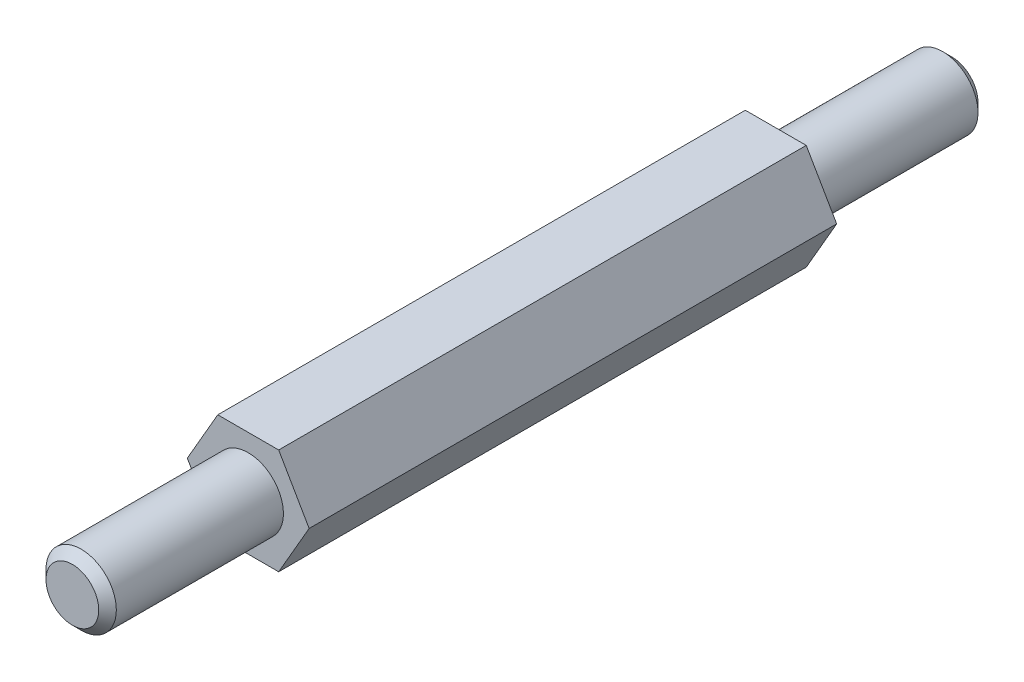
from build123d import *

# Parameters (mm, degrees)
BOSS_EXTRU_1_DEPTH = 30
ESQUISSE2_R        = 2
BOSS_EXTRU_2_DEPTH = 10
BOSS_EXTRU_3_START = 10
ESQUISSE3_R        = 2
BOSS_EXTRU_3_DEPTH = 10
CHANFREIN1_SIZE    = 0.5


with BuildPart() as part:
    # Esquisse1 → Boss.-Extru.1 (new body)
    with BuildSketch(Plane.XY):
        Polygon((-3.464101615, 0), (-1.732050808, 3), (1.732050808, 3), (3.464101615, 0), (1.732050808, -3), (-1.732050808, -3), align=None)
    extrude(amount=BOSS_EXTRU_1_DEPTH)

    # Esquisse2 → Boss.-Extru.2 (add)
    with BuildSketch(Plane.XY.offset(30)):
        with Locations(Location((0, 0, 0), (0, 0, 180))):
            Circle(ESQUISSE2_R)
    extrude(amount=BOSS_EXTRU_2_DEPTH)

    # Esquisse3 → Boss.-Extru.3 (add)
    with BuildSketch(Plane(origin=(0, 0, 0), x_dir=(-1, 0, 0), z_dir=(0, 0, -1)).offset(BOSS_EXTRU_3_START)):
        Circle(ESQUISSE3_R)
    extrude(amount=-BOSS_EXTRU_3_DEPTH)

    # Chanfrein1
    chanfrein1_edges = [part.edges().sort_by_distance(p)[0] for p in [
        (2, 0, 40),
        (2, 0, -10),
    ]]
    chamfer(chanfrein1_edges, length=CHANFREIN1_SIZE)


solid = part.part
